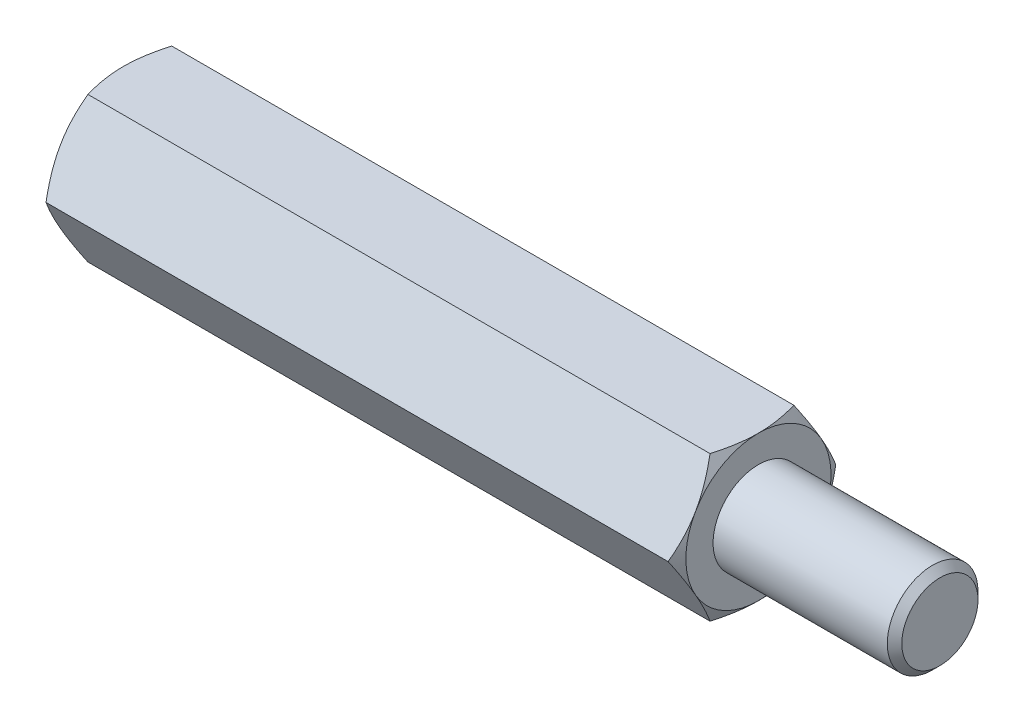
ISO-10303-21;
HEADER;
FILE_DESCRIPTION(('STEP AP214'),'2;1');
FILE_NAME('part.step','',(''),(''),'','','');
FILE_SCHEMA(('AUTOMOTIVE_DESIGN { 1 0 10303 214 1 1 1 1 }'));
ENDSEC;
DATA;
#1=APPLICATION_CONTEXT('core data for automotive mechanical design processes');
#2=APPLICATION_PROTOCOL_DEFINITION('international standard','automotive_design',2000,#1);
#3=PRODUCT_CONTEXT('',#1,'mechanical');
#4=PRODUCT('Part','Part','',(#3));
#5=PRODUCT_RELATED_PRODUCT_CATEGORY('part','',(#4));
#6=PRODUCT_DEFINITION_FORMATION('','',#4);
#7=PRODUCT_DEFINITION_CONTEXT('part definition',#1,'design');
#8=PRODUCT_DEFINITION('design','',#6,#7);
#9=PRODUCT_DEFINITION_SHAPE('','',#8);
#10=(LENGTH_UNIT() NAMED_UNIT(*) SI_UNIT(.MILLI.,.METRE.));
#11=(NAMED_UNIT(*) PLANE_ANGLE_UNIT() SI_UNIT($,.RADIAN.));
#12=(NAMED_UNIT(*) SI_UNIT($,.STERADIAN.) SOLID_ANGLE_UNIT());
#13=UNCERTAINTY_MEASURE_WITH_UNIT(LENGTH_MEASURE(1.E-05),#10,'distance_accuracy_value','');
#14=(GEOMETRIC_REPRESENTATION_CONTEXT(3) GLOBAL_UNCERTAINTY_ASSIGNED_CONTEXT((#13)) GLOBAL_UNIT_ASSIGNED_CONTEXT((#10,
#11,#12)) REPRESENTATION_CONTEXT('',''));
#15=CARTESIAN_POINT('',(0.,0.,0.));
#16=DIRECTION('',(0.,0.,1.));
#17=DIRECTION('',(1.,0.,0.));
#18=AXIS2_PLACEMENT_3D('',#15,#16,#17);
#19=CARTESIAN_POINT('',(17.5,4.,-2.3094010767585));
#20=DIRECTION('',(1.,0.,0.));
#21=DIRECTION('',(0.,0.,-1.));
#22=AXIS2_PLACEMENT_3D('',#19,#20,#21);
#23=PLANE('',#22);
#24=CARTESIAN_POINT('',(17.5,0.,0.));
#25=DIRECTION('',(1.,0.,0.));
#26=DIRECTION('',(0.,0.,-1.));
#27=AXIS2_PLACEMENT_3D('',#24,#25,#26);
#28=CIRCLE('',#27,4.);
#29=CARTESIAN_POINT('',(17.5,-2.,-3.46410161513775));
#30=VERTEX_POINT('',#29);
#31=CARTESIAN_POINT('',(17.5,2.,-3.46410161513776));
#32=VERTEX_POINT('',#31);
#33=EDGE_CURVE('E288',#30,#32,#28,.T.);
#34=ORIENTED_EDGE('',*,*,#33,.T.);
#35=CARTESIAN_POINT('',(17.5,4.,0.));
#36=VERTEX_POINT('',#35);
#37=EDGE_CURVE('E53',#32,#36,#28,.T.);
#38=ORIENTED_EDGE('',*,*,#37,.T.);
#39=CARTESIAN_POINT('',(17.5,2.,3.46410161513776));
#40=VERTEX_POINT('',#39);
#41=EDGE_CURVE('E297',#36,#40,#28,.T.);
#42=ORIENTED_EDGE('',*,*,#41,.T.);
#43=CARTESIAN_POINT('',(17.5,-2.,3.46410161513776));
#44=VERTEX_POINT('',#43);
#45=EDGE_CURVE('E303',#40,#44,#28,.T.);
#46=ORIENTED_EDGE('',*,*,#45,.T.);
#47=CARTESIAN_POINT('',(17.5,0.,0.));
#48=DIRECTION('',(-1.,0.,0.));
#49=DIRECTION('',(0.,-1.,0.));
#50=AXIS2_PLACEMENT_3D('',#47,#48,#49);
#51=CIRCLE('',#50,4.);
#52=CARTESIAN_POINT('',(17.5,-4.00000000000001,0.));
#53=VERTEX_POINT('',#52);
#54=EDGE_CURVE('E193',#53,#44,#51,.T.);
#55=ORIENTED_EDGE('',*,*,#54,.F.);
#56=EDGE_CURVE('E61',#53,#30,#28,.T.);
#57=ORIENTED_EDGE('',*,*,#56,.T.);
#58=EDGE_LOOP('',(#34,#38,#42,#46,#55,#57));
#59=FACE_BOUND('',#58,.T.);
#60=CARTESIAN_POINT('',(17.5,0.,0.));
#61=DIRECTION('',(1.,0.,0.));
#62=DIRECTION('',(0.,0.,-1.));
#63=AXIS2_PLACEMENT_3D('',#60,#61,#62);
#64=CIRCLE('',#63,2.5);
#65=CARTESIAN_POINT('',(17.5,0.,-2.5));
#66=VERTEX_POINT('',#65);
#67=EDGE_CURVE('E392',#66,#66,#64,.T.);
#68=ORIENTED_EDGE('',*,*,#67,.F.);
#69=EDGE_LOOP('',(#68));
#70=FACE_BOUND('',#69,.T.);
#71=ADVANCED_FACE('F37',(#59,#70),#23,.T.);
#72=CARTESIAN_POINT('',(17.5,0.,-4.61880215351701));
#73=DIRECTION('',(0.,-0.5,0.866025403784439));
#74=DIRECTION('',(0.,-0.866025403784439,-0.5));
#75=AXIS2_PLACEMENT_3D('',#72,#73,#74);
#76=PLANE('',#75);
#77=CARTESIAN_POINT('',(17.1426677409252,-0.000200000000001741,-4.61891762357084));
#78=CARTESIAN_POINT('',(17.2012821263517,0.175579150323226,-4.5174314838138));
#79=CARTESIAN_POINT('',(17.2545896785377,0.352875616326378,-4.41506932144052));
#80=CARTESIAN_POINT('',(17.3476383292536,0.710538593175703,-4.20857250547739));
#81=CARTESIAN_POINT('',(17.3873465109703,0.890911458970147,-4.10443418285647));
#82=CARTESIAN_POINT('',(17.4491577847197,1.24942181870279,-3.89744813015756));
#83=CARTESIAN_POINT('',(17.4716722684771,1.42750415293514,-3.79463224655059));
#84=CARTESIAN_POINT('',(17.4985493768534,1.7845067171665,-3.58851671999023));
#85=CARTESIAN_POINT('',(17.5029342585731,1.96342564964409,-3.48521782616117));
#86=CARTESIAN_POINT('',(17.49380992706,2.29774284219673,-3.29219970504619));
#87=CARTESIAN_POINT('',(17.482541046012,2.45319115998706,-3.20245157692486));
#88=CARTESIAN_POINT('',(17.4468260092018,2.76307505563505,-3.02354002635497));
#89=CARTESIAN_POINT('',(17.4223676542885,2.91750956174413,-2.93437722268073));
#90=CARTESIAN_POINT('',(17.3612239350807,3.22803232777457,-2.75509682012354));
#91=CARTESIAN_POINT('',(17.3242793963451,3.3840812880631,-2.6650019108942));
#92=CARTESIAN_POINT('',(17.240429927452,3.69385183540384,-2.48615580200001));
#93=CARTESIAN_POINT('',(17.1935446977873,3.84757739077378,-2.39740231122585));
#94=CARTESIAN_POINT('',(17.1426677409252,4.0002,-2.30928560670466));
#95=B_SPLINE_CURVE_WITH_KNOTS('',3,(#77,#78,#79,#80,#81,#82,#83,#84,#85,#86,#87,#88,#89,#90,#91,
#92,#93,#94),.UNSPECIFIED.,.F.,.F.,(4,2,2,2,2,2,2,2,4),(0.,0.634047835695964,1.26961969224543,
1.88946157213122,2.50854226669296,3.04757825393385,3.58711366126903,4.13861653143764,
4.68903648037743),.UNSPECIFIED.);
#96=CARTESIAN_POINT('',(17.1427344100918,0.,-4.61880215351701));
#97=VERTEX_POINT('',#96);
#98=EDGE_CURVE('E317',#97,#32,#95,.T.);
#99=ORIENTED_EDGE('',*,*,#98,.F.);
#100=DIRECTION('',(-1.,0.,0.));
#101=VECTOR('',#100,1.);
#102=CARTESIAN_POINT('',(17.5,0.,-4.61880215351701));
#103=LINE('',#102,#101);
#104=CARTESIAN_POINT('',(-17.1427344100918,0.,-4.61880215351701));
#105=VERTEX_POINT('',#104);
#106=EDGE_CURVE('E264',#97,#105,#103,.T.);
#107=ORIENTED_EDGE('',*,*,#106,.T.);
#108=CARTESIAN_POINT('',(-17.1426677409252,4.0002,-2.30928560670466));
#109=CARTESIAN_POINT('',(-17.2012821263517,3.82442084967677,-2.4107717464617));
#110=CARTESIAN_POINT('',(-17.2545896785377,3.64712438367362,-2.51313390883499));
#111=CARTESIAN_POINT('',(-17.3476383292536,3.28946140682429,-2.71963072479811));
#112=CARTESIAN_POINT('',(-17.3873465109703,3.10908854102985,-2.82376904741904));
#113=CARTESIAN_POINT('',(-17.4491577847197,2.75057818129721,-3.03075510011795));
#114=CARTESIAN_POINT('',(-17.4716722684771,2.57249584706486,-3.13357098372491));
#115=CARTESIAN_POINT('',(-17.4985493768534,2.21549328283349,-3.33968651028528));
#116=CARTESIAN_POINT('',(-17.5029342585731,2.0365743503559,-3.44298540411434));
#117=CARTESIAN_POINT('',(-17.49380992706,1.70225715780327,-3.63600352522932));
#118=CARTESIAN_POINT('',(-17.482541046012,1.54680884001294,-3.72575165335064));
#119=CARTESIAN_POINT('',(-17.4468260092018,1.23692494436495,-3.90466320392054));
#120=CARTESIAN_POINT('',(-17.4223676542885,1.08249043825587,-3.99382600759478));
#121=CARTESIAN_POINT('',(-17.3612239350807,0.771967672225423,-4.17310641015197));
#122=CARTESIAN_POINT('',(-17.3242793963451,0.615918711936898,-4.26320131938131));
#123=CARTESIAN_POINT('',(-17.240429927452,0.30614816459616,-4.4420474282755));
#124=CARTESIAN_POINT('',(-17.1935446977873,0.15242260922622,-4.53080091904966));
#125=CARTESIAN_POINT('',(-17.1426677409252,-0.000200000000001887,-4.61891762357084));
#126=B_SPLINE_CURVE_WITH_KNOTS('',3,(#108,#109,#110,#111,#112,#113,#114,#115,#116,#117,#118,
#119,#120,#121,#122,#123,#124,#125),.UNSPECIFIED.,.F.,.F.,(4,2,2,2,2,2,2,2,4),(0.,
0.634047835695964,1.26961969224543,1.88946157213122,2.50854226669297,3.04757825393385,
3.58711366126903,4.13861653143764,4.68903648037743),.UNSPECIFIED.);
#127=CARTESIAN_POINT('',(-17.5,2.,-3.46410161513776));
#128=VERTEX_POINT('',#127);
#129=EDGE_CURVE('E332',#128,#105,#126,.T.);
#130=ORIENTED_EDGE('',*,*,#129,.F.);
#131=CARTESIAN_POINT('',(-17.1427344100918,4.,-2.3094010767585));
#132=VERTEX_POINT('',#131);
#133=EDGE_CURVE('E335',#132,#128,#126,.T.);
#134=ORIENTED_EDGE('',*,*,#133,.F.);
#135=DIRECTION('',(-1.,0.,0.));
#136=VECTOR('',#135,1.);
#137=CARTESIAN_POINT('',(17.5,4.,-2.3094010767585));
#138=LINE('',#137,#136);
#139=CARTESIAN_POINT('',(17.142734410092,4.,-2.30940107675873));
#140=VERTEX_POINT('',#139);
#141=EDGE_CURVE('E279',#140,#132,#138,.T.);
#142=ORIENTED_EDGE('',*,*,#141,.F.);
#143=EDGE_CURVE('E229',#32,#140,#95,.T.);
#144=ORIENTED_EDGE('',*,*,#143,.F.);
#145=EDGE_LOOP('',(#99,#107,#130,#134,#142,#144));
#146=FACE_BOUND('',#145,.T.);
#147=ADVANCED_FACE('F148',(#146),#76,.F.);
#148=CARTESIAN_POINT('',(17.5,4.,-2.3094010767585));
#149=DIRECTION('',(0.,-1.,0.));
#150=DIRECTION('',(0.,0.,-1.));
#151=AXIS2_PLACEMENT_3D('',#148,#149,#150);
#152=PLANE('',#151);
#153=CARTESIAN_POINT('',(15.5082907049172,4.,-6.28479524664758));
#154=CARTESIAN_POINT('',(15.5937006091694,4.,-6.10939349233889));
#155=CARTESIAN_POINT('',(15.6783148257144,4.,-5.93359774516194));
#156=CARTESIAN_POINT('',(15.8455059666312,4.,-5.58100905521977));
#157=CARTESIAN_POINT('',(15.9280825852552,4.,-5.40421596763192));
#158=CARTESIAN_POINT('',(16.0911508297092,4.,-5.04855089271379));
#159=CARTESIAN_POINT('',(16.1716293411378,4.,-4.86967287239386));
#160=CARTESIAN_POINT('',(16.329400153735,4.,-4.51052237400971));
#161=CARTESIAN_POINT('',(16.406692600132,4.,-4.33024995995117));
#162=CARTESIAN_POINT('',(16.559802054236,4.,-3.96189114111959));
#163=CARTESIAN_POINT('',(16.635480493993,4.,-3.77374683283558));
#164=CARTESIAN_POINT('',(16.7813045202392,4.,-3.39528725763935));
#165=CARTESIAN_POINT('',(16.8514494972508,4.,-3.2049717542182));
#166=CARTESIAN_POINT('',(16.9844245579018,4.,-2.82219775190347));
#167=CARTESIAN_POINT('',(17.0472687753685,4.,-2.62974421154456));
#168=CARTESIAN_POINT('',(17.1636796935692,4.,-2.24207725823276));
#169=CARTESIAN_POINT('',(17.2172492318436,4.,-2.04686470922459));
#170=CARTESIAN_POINT('',(17.3123031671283,4.,-1.65467425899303));
#171=CARTESIAN_POINT('',(17.3538563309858,4.,-1.45771333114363));
#172=CARTESIAN_POINT('',(17.4225903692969,4.,-1.06125849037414));
#173=CARTESIAN_POINT('',(17.4497727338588,4.,-0.861764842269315));
#174=CARTESIAN_POINT('',(17.4872447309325,4.,-0.463879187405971));
#175=CARTESIAN_POINT('',(17.4977578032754,4.,-0.265508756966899));
#176=CARTESIAN_POINT('',(17.5015934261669,4.,0.131417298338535));
#177=CARTESIAN_POINT('',(17.4949158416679,4.,0.32997292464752));
#178=CARTESIAN_POINT('',(17.4696489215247,4.,0.66469218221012));
#179=CARTESIAN_POINT('',(17.4553708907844,4.,0.801202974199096));
#180=CARTESIAN_POINT('',(17.4195349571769,4.,1.07327201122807));
#181=CARTESIAN_POINT('',(17.3979761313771,4.,1.20883013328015));
#182=CARTESIAN_POINT('',(17.3235066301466,4.,1.61386939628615));
#183=CARTESIAN_POINT('',(17.2608149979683,4.,1.88157484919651));
#184=CARTESIAN_POINT('',(17.1515117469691,4.,2.28197262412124));
#185=CARTESIAN_POINT('',(17.112009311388,4.,2.41672443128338));
#186=CARTESIAN_POINT('',(17.0287523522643,4.,2.68492067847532));
#187=CARTESIAN_POINT('',(16.9849977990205,4.,2.81836510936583));
#188=CARTESIAN_POINT('',(16.8939510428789,4.,3.08398596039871));
#189=CARTESIAN_POINT('',(16.846659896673,4.,3.21616274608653));
#190=CARTESIAN_POINT('',(16.7491111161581,4.,3.47941134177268));
#191=CARTESIAN_POINT('',(16.6988535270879,4.,3.61048316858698));
#192=CARTESIAN_POINT('',(16.5713295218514,4.,3.93385125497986));
#193=CARTESIAN_POINT('',(16.4926014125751,4.,4.12557021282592));
#194=CARTESIAN_POINT('',(16.3309693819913,4.,4.50724553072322));
#195=CARTESIAN_POINT('',(16.2480651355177,4.,4.69720175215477));
#196=CARTESIAN_POINT('',(16.0789699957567,4.,5.07569950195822));
#197=CARTESIAN_POINT('',(15.9927782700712,4.,5.26424065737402));
#198=CARTESIAN_POINT('',(15.8178011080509,4.,5.64011758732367));
#199=CARTESIAN_POINT('',(15.7290156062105,4.,5.82745333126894));
#200=CARTESIAN_POINT('',(15.4593432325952,4.,6.38844423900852));
#201=CARTESIAN_POINT('',(15.2753561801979,4.,6.76060781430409));
#202=CARTESIAN_POINT('',(14.9019562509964,4.,7.50211228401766));
#203=CARTESIAN_POINT('',(14.7125442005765,4.,7.87145359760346));
#204=CARTESIAN_POINT('',(14.3473877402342,4.,8.57450173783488));
#205=CARTESIAN_POINT('',(14.171975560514,4.,8.90838144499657));
#206=CARTESIAN_POINT('',(13.8188097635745,4.,9.57491712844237));
#207=CARTESIAN_POINT('',(13.6410560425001,4.,9.90757304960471));
#208=CARTESIAN_POINT('',(13.2842933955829,4.,10.5709822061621));
#209=CARTESIAN_POINT('',(13.1052895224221,3.99999999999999,10.9017381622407));
#210=CARTESIAN_POINT('',(12.7459071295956,3.99999999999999,11.5624752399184));
#211=CARTESIAN_POINT('',(12.5655286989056,3.99999999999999,11.8924564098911));
#212=CARTESIAN_POINT('',(12.384642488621,3.99999999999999,12.2221569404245));
#213=B_SPLINE_CURVE_WITH_KNOTS('',3,(#153,#154,#155,#156,#157,#158,#159,#160,#161,#162,#163,
#164,#165,#166,#167,#168,#169,#170,#171,#172,#173,#174,#175,#176,#177,#178,#179,#180,#181,#182,
#183,#184,#185,#186,#187,#188,#189,#190,#191,#192,#193,#194,#195,#196,#197,#198,#199,#200,#201,
#202,#203,#204,#205,#206,#207,#208,#209,#210,#211,#212),.UNSPECIFIED.,.F.,.F.,(4,2,2,2,2,2,2,2,
2,2,2,2,2,2,2,2,2,2,2,2,2,2,2,2,2,2,2,2,2,4),(0.,0.58528075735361,1.17064881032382,
1.75906864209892,2.34746162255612,2.95577704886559,3.56415938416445,4.17134357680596,
4.7783416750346,5.38179402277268,5.98518378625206,6.58041501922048,7.17565092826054,
7.5872191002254,7.99883946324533,8.82250155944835,9.24373134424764,9.66496407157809,
10.086071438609,10.5071723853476,11.1288656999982,11.7506074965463,12.3725077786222,
12.9944237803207,14.2398211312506,15.4850297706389,16.6164791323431,17.7479788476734,
18.8762380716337,20.0044248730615),.UNSPECIFIED.);
#214=EDGE_CURVE('E227',#140,#36,#213,.T.);
#215=ORIENTED_EDGE('',*,*,#214,.F.);
#216=ORIENTED_EDGE('',*,*,#141,.T.);
#217=CARTESIAN_POINT('',(-15.5082907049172,4.,-6.28479524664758));
#218=CARTESIAN_POINT('',(-15.5937006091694,4.,-6.10939349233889));
#219=CARTESIAN_POINT('',(-15.6783148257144,4.,-5.93359774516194));
#220=CARTESIAN_POINT('',(-15.8455059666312,4.,-5.58100905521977));
#221=CARTESIAN_POINT('',(-15.9280825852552,4.,-5.40421596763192));
#222=CARTESIAN_POINT('',(-16.0911508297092,4.,-5.04855089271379));
#223=CARTESIAN_POINT('',(-16.1716293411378,4.,-4.86967287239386));
#224=CARTESIAN_POINT('',(-16.329400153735,4.,-4.51052237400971));
#225=CARTESIAN_POINT('',(-16.406692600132,4.,-4.33024995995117));
#226=CARTESIAN_POINT('',(-16.559802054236,4.,-3.96189114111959));
#227=CARTESIAN_POINT('',(-16.635480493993,4.,-3.77374683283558));
#228=CARTESIAN_POINT('',(-16.7813045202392,4.,-3.39528725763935));
#229=CARTESIAN_POINT('',(-16.8514494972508,4.,-3.2049717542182));
#230=CARTESIAN_POINT('',(-16.9844245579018,4.,-2.82219775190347));
#231=CARTESIAN_POINT('',(-17.0472687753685,4.,-2.62974421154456));
#232=CARTESIAN_POINT('',(-17.1636796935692,4.,-2.24207725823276));
#233=CARTESIAN_POINT('',(-17.2172492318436,4.,-2.04686470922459));
#234=CARTESIAN_POINT('',(-17.3123031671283,4.,-1.65467425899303));
#235=CARTESIAN_POINT('',(-17.3538563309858,4.,-1.45771333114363));
#236=CARTESIAN_POINT('',(-17.4225903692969,4.,-1.06125849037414));
#237=CARTESIAN_POINT('',(-17.4497727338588,4.,-0.861764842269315));
#238=CARTESIAN_POINT('',(-17.4872447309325,4.,-0.463879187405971));
#239=CARTESIAN_POINT('',(-17.4977578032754,4.,-0.265508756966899));
#240=CARTESIAN_POINT('',(-17.5015934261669,4.,0.131417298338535));
#241=CARTESIAN_POINT('',(-17.4949158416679,4.,0.32997292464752));
#242=CARTESIAN_POINT('',(-17.4696489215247,4.,0.66469218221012));
#243=CARTESIAN_POINT('',(-17.4553708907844,4.,0.801202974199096));
#244=CARTESIAN_POINT('',(-17.4195349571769,4.,1.07327201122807));
#245=CARTESIAN_POINT('',(-17.3979761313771,4.,1.20883013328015));
#246=CARTESIAN_POINT('',(-17.3235066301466,4.,1.61386939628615));
#247=CARTESIAN_POINT('',(-17.2608149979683,4.,1.88157484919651));
#248=CARTESIAN_POINT('',(-17.1515117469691,4.,2.28197262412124));
#249=CARTESIAN_POINT('',(-17.112009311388,4.,2.41672443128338));
#250=CARTESIAN_POINT('',(-17.0287523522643,4.,2.68492067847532));
#251=CARTESIAN_POINT('',(-16.9849977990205,4.,2.81836510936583));
#252=CARTESIAN_POINT('',(-16.8939510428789,4.,3.08398596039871));
#253=CARTESIAN_POINT('',(-16.846659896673,4.,3.21616274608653));
#254=CARTESIAN_POINT('',(-16.7491111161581,4.,3.47941134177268));
#255=CARTESIAN_POINT('',(-16.6988535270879,4.,3.61048316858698));
#256=CARTESIAN_POINT('',(-16.5713295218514,4.,3.93385125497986));
#257=CARTESIAN_POINT('',(-16.4926014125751,4.,4.12557021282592));
#258=CARTESIAN_POINT('',(-16.3309693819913,4.,4.50724553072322));
#259=CARTESIAN_POINT('',(-16.2480651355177,4.,4.69720175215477));
#260=CARTESIAN_POINT('',(-16.0789699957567,4.,5.07569950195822));
#261=CARTESIAN_POINT('',(-15.9927782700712,4.,5.26424065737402));
#262=CARTESIAN_POINT('',(-15.8178011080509,4.,5.64011758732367));
#263=CARTESIAN_POINT('',(-15.7290156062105,4.,5.82745333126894));
#264=CARTESIAN_POINT('',(-15.4593432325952,4.,6.38844423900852));
#265=CARTESIAN_POINT('',(-15.2753561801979,4.,6.76060781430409));
#266=CARTESIAN_POINT('',(-14.9019562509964,4.,7.50211228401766));
#267=CARTESIAN_POINT('',(-14.7125442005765,4.,7.87145359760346));
#268=CARTESIAN_POINT('',(-14.3473877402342,4.,8.57450173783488));
#269=CARTESIAN_POINT('',(-14.171975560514,4.,8.90838144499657));
#270=CARTESIAN_POINT('',(-13.8188097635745,4.,9.57491712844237));
#271=CARTESIAN_POINT('',(-13.6410560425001,4.,9.90757304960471));
#272=CARTESIAN_POINT('',(-13.2842933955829,4.,10.5709822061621));
#273=CARTESIAN_POINT('',(-13.1052895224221,3.99999999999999,10.9017381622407));
#274=CARTESIAN_POINT('',(-12.7459071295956,3.99999999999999,11.5624752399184));
#275=CARTESIAN_POINT('',(-12.5655286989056,3.99999999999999,11.8924564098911));
#276=CARTESIAN_POINT('',(-12.384642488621,3.99999999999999,12.2221569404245));
#277=B_SPLINE_CURVE_WITH_KNOTS('',3,(#217,#218,#219,#220,#221,#222,#223,#224,#225,#226,#227,
#228,#229,#230,#231,#232,#233,#234,#235,#236,#237,#238,#239,#240,#241,#242,#243,#244,#245,#246,
#247,#248,#249,#250,#251,#252,#253,#254,#255,#256,#257,#258,#259,#260,#261,#262,#263,#264,#265,
#266,#267,#268,#269,#270,#271,#272,#273,#274,#275,#276),.UNSPECIFIED.,.F.,.F.,(4,2,2,2,2,2,2,2,
2,2,2,2,2,2,2,2,2,2,2,2,2,2,2,2,2,2,2,2,2,4),(0.,0.58528075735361,1.17064881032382,
1.75906864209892,2.34746162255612,2.95577704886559,3.56415938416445,4.17134357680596,
4.7783416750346,5.38179402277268,5.98518378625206,6.58041501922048,7.17565092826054,
7.5872191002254,7.99883946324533,8.82250155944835,9.24373134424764,9.66496407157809,
10.086071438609,10.5071723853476,11.1288656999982,11.7506074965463,12.3725077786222,
12.9944237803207,14.2398211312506,15.4850297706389,16.6164791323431,17.7479788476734,
18.8762380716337,20.0044248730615),.UNSPECIFIED.);
#278=CARTESIAN_POINT('',(-17.5,4.,0.));
#279=VERTEX_POINT('',#278);
#280=EDGE_CURVE('E241',#279,#132,#277,.F.);
#281=ORIENTED_EDGE('',*,*,#280,.F.);
#282=CARTESIAN_POINT('',(-17.1427344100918,4.,2.3094010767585));
#283=VERTEX_POINT('',#282);
#284=EDGE_CURVE('E249',#283,#279,#277,.F.);
#285=ORIENTED_EDGE('',*,*,#284,.F.);
#286=DIRECTION('',(-1.,0.,0.));
#287=VECTOR('',#286,1.);
#288=CARTESIAN_POINT('',(17.5,4.,2.3094010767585));
#289=LINE('',#288,#287);
#290=CARTESIAN_POINT('',(17.1427344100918,4.,2.3094010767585));
#291=VERTEX_POINT('',#290);
#292=EDGE_CURVE('E276',#291,#283,#289,.T.);
#293=ORIENTED_EDGE('',*,*,#292,.F.);
#294=EDGE_CURVE('E221',#36,#291,#213,.T.);
#295=ORIENTED_EDGE('',*,*,#294,.F.);
#296=EDGE_LOOP('',(#215,#216,#281,#285,#293,#295));
#297=FACE_BOUND('',#296,.T.);
#298=ADVANCED_FACE('F153',(#297),#152,.F.);
#299=CARTESIAN_POINT('',(17.5,4.,2.3094010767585));
#300=DIRECTION('',(0.,-0.5,-0.866025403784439));
#301=DIRECTION('',(0.,0.866025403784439,-0.5));
#302=AXIS2_PLACEMENT_3D('',#299,#300,#301);
#303=PLANE('',#302);
#304=CARTESIAN_POINT('',(17.1426677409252,4.0002,2.30928560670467));
#305=CARTESIAN_POINT('',(17.2012821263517,3.82442084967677,2.4107717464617));
#306=CARTESIAN_POINT('',(17.2545896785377,3.64712438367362,2.51313390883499));
#307=CARTESIAN_POINT('',(17.3476383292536,3.28946140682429,2.71963072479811));
#308=CARTESIAN_POINT('',(17.3873465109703,3.10908854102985,2.82376904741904));
#309=CARTESIAN_POINT('',(17.4491577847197,2.75057818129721,3.03075510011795));
#310=CARTESIAN_POINT('',(17.4716722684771,2.57249584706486,3.13357098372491));
#311=CARTESIAN_POINT('',(17.4985493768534,2.21549328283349,3.33968651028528));
#312=CARTESIAN_POINT('',(17.5029342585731,2.0365743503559,3.44298540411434));
#313=CARTESIAN_POINT('',(17.49380992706,1.70225715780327,3.63600352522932));
#314=CARTESIAN_POINT('',(17.482541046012,1.54680884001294,3.72575165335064));
#315=CARTESIAN_POINT('',(17.4468260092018,1.23692494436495,3.90466320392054));
#316=CARTESIAN_POINT('',(17.4223676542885,1.08249043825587,3.99382600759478));
#317=CARTESIAN_POINT('',(17.3612239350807,0.771967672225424,4.17310641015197));
#318=CARTESIAN_POINT('',(17.3242793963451,0.615918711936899,4.26320131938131));
#319=CARTESIAN_POINT('',(17.240429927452,0.306148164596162,4.4420474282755));
#320=CARTESIAN_POINT('',(17.1935446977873,0.152422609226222,4.53080091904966));
#321=CARTESIAN_POINT('',(17.1426677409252,-0.00019999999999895,4.61891762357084));
#322=B_SPLINE_CURVE_WITH_KNOTS('',3,(#304,#305,#306,#307,#308,#309,#310,#311,#312,#313,#314,
#315,#316,#317,#318,#319,#320,#321),.UNSPECIFIED.,.F.,.F.,(4,2,2,2,2,2,2,2,4),(0.,
0.634047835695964,1.26961969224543,1.88946157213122,2.50854226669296,3.04757825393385,
3.58711366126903,4.13861653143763,4.68903648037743),.UNSPECIFIED.);
#323=EDGE_CURVE('E228',#291,#40,#322,.T.);
#324=ORIENTED_EDGE('',*,*,#323,.F.);
#325=ORIENTED_EDGE('',*,*,#292,.T.);
#326=CARTESIAN_POINT('',(-17.1426677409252,-0.000199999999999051,4.61891762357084));
#327=CARTESIAN_POINT('',(-17.2012821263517,0.175579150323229,4.5174314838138));
#328=CARTESIAN_POINT('',(-17.2545896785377,0.352875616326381,4.41506932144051));
#329=CARTESIAN_POINT('',(-17.3476383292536,0.710538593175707,4.20857250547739));
#330=CARTESIAN_POINT('',(-17.3873465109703,0.89091145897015,4.10443418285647));
#331=CARTESIAN_POINT('',(-17.4491577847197,1.24942181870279,3.89744813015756));
#332=CARTESIAN_POINT('',(-17.4716722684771,1.42750415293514,3.79463224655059));
#333=CARTESIAN_POINT('',(-17.4985493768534,1.78450671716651,3.58851671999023));
#334=CARTESIAN_POINT('',(-17.5029342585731,1.9634256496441,3.48521782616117));
#335=CARTESIAN_POINT('',(-17.49380992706,2.29774284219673,3.29219970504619));
#336=CARTESIAN_POINT('',(-17.482541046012,2.45319115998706,3.20245157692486));
#337=CARTESIAN_POINT('',(-17.4468260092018,2.76307505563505,3.02354002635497));
#338=CARTESIAN_POINT('',(-17.4223676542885,2.91750956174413,2.93437722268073));
#339=CARTESIAN_POINT('',(-17.3612239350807,3.22803232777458,2.75509682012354));
#340=CARTESIAN_POINT('',(-17.3242793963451,3.3840812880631,2.6650019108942));
#341=CARTESIAN_POINT('',(-17.240429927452,3.69385183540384,2.48615580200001));
#342=CARTESIAN_POINT('',(-17.1935446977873,3.84757739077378,2.39740231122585));
#343=CARTESIAN_POINT('',(-17.1426677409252,4.0002,2.30928560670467));
#344=B_SPLINE_CURVE_WITH_KNOTS('',3,(#326,#327,#328,#329,#330,#331,#332,#333,#334,#335,#336,
#337,#338,#339,#340,#341,#342,#343),.UNSPECIFIED.,.F.,.F.,(4,2,2,2,2,2,2,2,4),(0.,
0.634047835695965,1.26961969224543,1.88946157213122,2.50854226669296,3.04757825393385,
3.58711366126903,4.13861653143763,4.68903648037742),.UNSPECIFIED.);
#345=CARTESIAN_POINT('',(-17.5,2.,3.46410161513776));
#346=VERTEX_POINT('',#345);
#347=EDGE_CURVE('E255',#346,#283,#344,.T.);
#348=ORIENTED_EDGE('',*,*,#347,.F.);
#349=CARTESIAN_POINT('',(-17.1427344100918,0.,4.618802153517));
#350=VERTEX_POINT('',#349);
#351=EDGE_CURVE('E262',#350,#346,#344,.T.);
#352=ORIENTED_EDGE('',*,*,#351,.F.);
#353=DIRECTION('',(-1.,0.,0.));
#354=VECTOR('',#353,1.);
#355=CARTESIAN_POINT('',(17.5,0.,4.618802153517));
#356=LINE('',#355,#354);
#357=CARTESIAN_POINT('',(17.1427344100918,0.,4.618802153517));
#358=VERTEX_POINT('',#357);
#359=EDGE_CURVE('E273',#358,#350,#356,.T.);
#360=ORIENTED_EDGE('',*,*,#359,.F.);
#361=EDGE_CURVE('E215',#40,#358,#322,.T.);
#362=ORIENTED_EDGE('',*,*,#361,.F.);
#363=EDGE_LOOP('',(#324,#325,#348,#352,#360,#362));
#364=FACE_BOUND('',#363,.T.);
#365=ADVANCED_FACE('F235',(#364),#303,.F.);
#366=CARTESIAN_POINT('',(17.5,0.,4.618802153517));
#367=DIRECTION('',(0.,0.5,-0.866025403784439));
#368=DIRECTION('',(0.,0.866025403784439,0.5));
#369=AXIS2_PLACEMENT_3D('',#366,#367,#368);
#370=PLANE('',#369);
#371=CARTESIAN_POINT('',(17.1426677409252,0.000200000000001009,4.61891762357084));
#372=CARTESIAN_POINT('',(17.2012821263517,-0.175579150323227,4.5174314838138));
#373=CARTESIAN_POINT('',(17.2545896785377,-0.35287561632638,4.41506932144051));
#374=CARTESIAN_POINT('',(17.3476383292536,-0.710538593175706,4.20857250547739));
#375=CARTESIAN_POINT('',(17.3873465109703,-0.89091145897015,4.10443418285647));
#376=CARTESIAN_POINT('',(17.4491577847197,-1.24942181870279,3.89744813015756));
#377=CARTESIAN_POINT('',(17.4716722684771,-1.42750415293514,3.79463224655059));
#378=CARTESIAN_POINT('',(17.4985493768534,-1.78450671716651,3.58851671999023));
#379=CARTESIAN_POINT('',(17.5029342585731,-1.9634256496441,3.48521782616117));
#380=CARTESIAN_POINT('',(17.49380992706,-2.29774284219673,3.29219970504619));
#381=CARTESIAN_POINT('',(17.482541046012,-2.45319115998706,3.20245157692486));
#382=CARTESIAN_POINT('',(17.4468260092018,-2.76307505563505,3.02354002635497));
#383=CARTESIAN_POINT('',(17.4223676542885,-2.91750956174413,2.93437722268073));
#384=CARTESIAN_POINT('',(17.3612239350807,-3.22803232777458,2.75509682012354));
#385=CARTESIAN_POINT('',(17.3242793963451,-3.3840812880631,2.6650019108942));
#386=CARTESIAN_POINT('',(17.240429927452,-3.69385183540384,2.48615580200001));
#387=CARTESIAN_POINT('',(17.1935446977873,-3.84757739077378,2.39740231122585));
#388=CARTESIAN_POINT('',(17.1426677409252,-4.0002,2.30928560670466));
#389=B_SPLINE_CURVE_WITH_KNOTS('',3,(#371,#372,#373,#374,#375,#376,#377,#378,#379,#380,#381,
#382,#383,#384,#385,#386,#387,#388),.UNSPECIFIED.,.F.,.F.,(4,2,2,2,2,2,2,2,4),(0.,
0.634047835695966,1.26961969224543,1.88946157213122,2.50854226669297,3.04757825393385,
3.58711366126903,4.13861653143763,4.68903648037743),.UNSPECIFIED.);
#390=EDGE_CURVE('E324',#358,#44,#389,.T.);
#391=ORIENTED_EDGE('',*,*,#390,.F.);
#392=ORIENTED_EDGE('',*,*,#359,.T.);
#393=CARTESIAN_POINT('',(-17.1426677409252,-4.0002,2.30928560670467));
#394=CARTESIAN_POINT('',(-17.2012821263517,-3.82442084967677,2.4107717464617));
#395=CARTESIAN_POINT('',(-17.2545896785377,-3.64712438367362,2.51313390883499));
#396=CARTESIAN_POINT('',(-17.3476383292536,-3.28946140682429,2.71963072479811));
#397=CARTESIAN_POINT('',(-17.3873465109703,-3.10908854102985,2.82376904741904));
#398=CARTESIAN_POINT('',(-17.4491577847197,-2.75057818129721,3.03075510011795));
#399=CARTESIAN_POINT('',(-17.4716722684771,-2.57249584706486,3.13357098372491));
#400=CARTESIAN_POINT('',(-17.4985493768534,-2.21549328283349,3.33968651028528));
#401=CARTESIAN_POINT('',(-17.5029342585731,-2.0365743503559,3.44298540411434));
#402=CARTESIAN_POINT('',(-17.49380992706,-1.70225715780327,3.63600352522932));
#403=CARTESIAN_POINT('',(-17.482541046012,-1.54680884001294,3.72575165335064));
#404=CARTESIAN_POINT('',(-17.4468260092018,-1.23692494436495,3.90466320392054));
#405=CARTESIAN_POINT('',(-17.4223676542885,-1.08249043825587,3.99382600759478));
#406=CARTESIAN_POINT('',(-17.3612239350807,-0.771967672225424,4.17310641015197));
#407=CARTESIAN_POINT('',(-17.3242793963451,-0.615918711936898,4.26320131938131));
#408=CARTESIAN_POINT('',(-17.240429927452,-0.30614816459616,4.4420474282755));
#409=CARTESIAN_POINT('',(-17.1935446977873,-0.152422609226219,4.53080091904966));
#410=CARTESIAN_POINT('',(-17.1426677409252,0.000200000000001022,4.61891762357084));
#411=B_SPLINE_CURVE_WITH_KNOTS('',3,(#393,#394,#395,#396,#397,#398,#399,#400,#401,#402,#403,
#404,#405,#406,#407,#408,#409,#410),.UNSPECIFIED.,.F.,.F.,(4,2,2,2,2,2,2,2,4),(0.,
0.634047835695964,1.26961969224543,1.88946157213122,2.50854226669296,3.04757825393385,
3.58711366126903,4.13861653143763,4.68903648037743),.UNSPECIFIED.);
#412=CARTESIAN_POINT('',(-17.5,-2.,3.46410161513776));
#413=VERTEX_POINT('',#412);
#414=EDGE_CURVE('E263',#413,#350,#411,.T.);
#415=ORIENTED_EDGE('',*,*,#414,.F.);
#416=CARTESIAN_POINT('',(-17.1427344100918,-4.,2.3094010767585));
#417=VERTEX_POINT('',#416);
#418=EDGE_CURVE('E250',#417,#413,#411,.T.);
#419=ORIENTED_EDGE('',*,*,#418,.F.);
#420=DIRECTION('',(-1.,0.,0.));
#421=VECTOR('',#420,1.);
#422=CARTESIAN_POINT('',(17.5,-4.,2.3094010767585));
#423=LINE('',#422,#421);
#424=CARTESIAN_POINT('',(17.1427344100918,-4.,2.3094010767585));
#425=VERTEX_POINT('',#424);
#426=EDGE_CURVE('E270',#425,#417,#423,.T.);
#427=ORIENTED_EDGE('',*,*,#426,.F.);
#428=EDGE_CURVE('E210',#44,#425,#389,.T.);
#429=ORIENTED_EDGE('',*,*,#428,.F.);
#430=EDGE_LOOP('',(#391,#392,#415,#419,#427,#429));
#431=FACE_BOUND('',#430,.T.);
#432=ADVANCED_FACE('F374',(#431),#370,.F.);
#433=CARTESIAN_POINT('',(17.5,-4.,2.3094010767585));
#434=DIRECTION('',(0.,1.,0.));
#435=DIRECTION('',(0.,0.,1.));
#436=AXIS2_PLACEMENT_3D('',#433,#434,#435);
#437=PLANE('',#436);
#438=CARTESIAN_POINT('',(15.5082907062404,-4.,-6.28479524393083));
#439=CARTESIAN_POINT('',(15.5937006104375,-4.,-6.10939348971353));
#440=CARTESIAN_POINT('',(15.6783148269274,-4.,-5.93359774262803));
#441=CARTESIAN_POINT('',(15.8455059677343,-4.,-5.58100905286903));
#442=CARTESIAN_POINT('',(15.9280825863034,-4.,-5.40421596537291));
#443=CARTESIAN_POINT('',(16.0911508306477,-4.,-5.04855089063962));
#444=CARTESIAN_POINT('',(16.1716293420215,-4.,-4.8696728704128));
#445=CARTESIAN_POINT('',(16.3294001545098,-4.,-4.51052237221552));
#446=CARTESIAN_POINT('',(16.4066926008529,-4.,-4.33024995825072));
#447=CARTESIAN_POINT('',(16.5598020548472,-4.,-3.96189113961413));
#448=CARTESIAN_POINT('',(16.6354804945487,-4.,-3.77374683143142));
#449=CARTESIAN_POINT('',(16.7813045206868,-4.,-3.39528725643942));
#450=CARTESIAN_POINT('',(16.8514494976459,-4.,-3.20497175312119));
#451=CARTESIAN_POINT('',(16.9844245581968,-4.,-2.82219775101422));
#452=CARTESIAN_POINT('',(17.0472687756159,-4.,-2.62974421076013));
#453=CARTESIAN_POINT('',(17.1636796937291,-4.,-2.24207725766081));
#454=CARTESIAN_POINT('',(17.2172492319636,-4.,-2.04686470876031));
#455=CARTESIAN_POINT('',(17.3123031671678,-4.,-1.65467425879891));
#456=CARTESIAN_POINT('',(17.3538563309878,-4.,-1.45771333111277));
#457=CARTESIAN_POINT('',(17.4225903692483,-4.,-1.06125849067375));
#458=CARTESIAN_POINT('',(17.4497727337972,-4.,-0.861764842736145));
#459=CARTESIAN_POINT('',(17.4872447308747,-4.,-0.463879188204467));
#460=CARTESIAN_POINT('',(17.4977578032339,-4.,-0.265508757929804));
#461=CARTESIAN_POINT('',(17.5015934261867,-4.,0.13141729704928));
#462=CARTESIAN_POINT('',(17.4949158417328,-4.,0.329972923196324));
#463=CARTESIAN_POINT('',(17.4696489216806,-4.,0.664692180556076));
#464=CARTESIAN_POINT('',(17.4553708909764,-4.,0.80120297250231));
#465=CARTESIAN_POINT('',(17.4195349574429,-4.,1.07327200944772));
#466=CARTESIAN_POINT('',(17.3979761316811,-4.,1.208830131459));
#467=CARTESIAN_POINT('',(17.3235066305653,-4.,1.61386939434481));
#468=CARTESIAN_POINT('',(17.2608149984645,-4.,1.88157484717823));
#469=CARTESIAN_POINT('',(17.1515117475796,-4.,2.28197262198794));
#470=CARTESIAN_POINT('',(17.1120093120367,-4.,2.41672442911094));
#471=CARTESIAN_POINT('',(17.0287523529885,-4.,2.68492067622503));
#472=CARTESIAN_POINT('',(16.9849977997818,-4.,2.81836510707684));
#473=CARTESIAN_POINT('',(16.8939510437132,-4.,3.08398595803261));
#474=CARTESIAN_POINT('',(16.8466598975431,-4.,3.21616274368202));
#475=CARTESIAN_POINT('',(16.7491111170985,-4.,3.47941133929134));
#476=CARTESIAN_POINT('',(16.6988535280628,-4.,3.61048316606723));
#477=CARTESIAN_POINT('',(16.5713295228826,-4.,3.93385125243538));
#478=CARTESIAN_POINT('',(16.4926014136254,-4.,4.12557021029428));
#479=CARTESIAN_POINT('',(16.330969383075,-4.,4.50724552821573));
#480=CARTESIAN_POINT('',(16.2480651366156,-4.,4.69720174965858));
#481=CARTESIAN_POINT('',(16.0789699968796,-4.,5.07569949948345));
#482=CARTESIAN_POINT('',(15.9927782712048,-4.,5.26424065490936));
#483=CARTESIAN_POINT('',(15.8178011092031,-4.,5.64011758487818));
#484=CARTESIAN_POINT('',(15.7290156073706,-4.,5.82745332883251));
#485=CARTESIAN_POINT('',(15.4593432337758,-4.,6.38844423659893));
#486=CARTESIAN_POINT('',(15.275356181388,-4.,6.76060781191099));
#487=CARTESIAN_POINT('',(14.9019562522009,-4.,7.50211228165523));
#488=CARTESIAN_POINT('',(14.7125442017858,-4.,7.8714535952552));
#489=CARTESIAN_POINT('',(14.3473877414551,-4.,8.57450173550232));
#490=CARTESIAN_POINT('',(14.171975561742,-4.,8.90838144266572));
#491=CARTESIAN_POINT('',(13.8188097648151,-4.,9.57491712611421));
#492=CARTESIAN_POINT('',(13.6410560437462,-4.,9.90757304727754));
#493=CARTESIAN_POINT('',(13.28429339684,-4.,10.5709822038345));
#494=CARTESIAN_POINT('',(13.1052895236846,-4.,10.9017381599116));
#495=CARTESIAN_POINT('',(12.7459071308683,-4.,11.562475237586));
#496=CARTESIAN_POINT('',(12.565528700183,-4.,11.8924564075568));
#497=CARTESIAN_POINT('',(12.384642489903,-4.,12.2221569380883));
#498=B_SPLINE_CURVE_WITH_KNOTS('',3,(#438,#439,#440,#441,#442,#443,#444,#445,#446,#447,#448,
#449,#450,#451,#452,#453,#454,#455,#456,#457,#458,#459,#460,#461,#462,#463,#464,#465,#466,#467,
#468,#469,#470,#471,#472,#473,#474,#475,#476,#477,#478,#479,#480,#481,#482,#483,#484,#485,#486,
#487,#488,#489,#490,#491,#492,#493,#494,#495,#496,#497),.UNSPECIFIED.,.F.,.F.,(4,2,2,2,2,2,2,2,
2,2,2,2,2,2,2,2,2,2,2,2,2,2,2,2,2,2,2,2,2,4),(0.,0.585280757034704,1.17064880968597,
1.75906864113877,2.34746162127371,2.95577704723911,3.56415938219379,4.17134357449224,
4.77834167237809,5.38179401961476,5.98518378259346,6.58041501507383,7.17565092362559,
7.5872190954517,7.99883945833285,8.82250155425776,9.24373133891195,9.66496406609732,
10.0860714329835,10.5071723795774,11.1288656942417,11.7506074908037,12.3725077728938,
12.9944237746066,14.2398211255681,15.4850297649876,16.6164791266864,17.7479788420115,
18.8762380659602,20.0044248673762),.UNSPECIFIED.);
#499=EDGE_CURVE('E325',#425,#53,#498,.F.);
#500=ORIENTED_EDGE('',*,*,#499,.F.);
#501=ORIENTED_EDGE('',*,*,#426,.T.);
#502=CARTESIAN_POINT('',(-15.5082907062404,-4.,-6.28479524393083));
#503=CARTESIAN_POINT('',(-15.5937006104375,-4.,-6.10939348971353));
#504=CARTESIAN_POINT('',(-15.6783148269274,-4.,-5.93359774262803));
#505=CARTESIAN_POINT('',(-15.8455059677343,-4.,-5.58100905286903));
#506=CARTESIAN_POINT('',(-15.9280825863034,-4.,-5.40421596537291));
#507=CARTESIAN_POINT('',(-16.0911508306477,-4.,-5.04855089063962));
#508=CARTESIAN_POINT('',(-16.1716293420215,-4.,-4.8696728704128));
#509=CARTESIAN_POINT('',(-16.3294001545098,-4.,-4.51052237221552));
#510=CARTESIAN_POINT('',(-16.4066926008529,-4.,-4.33024995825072));
#511=CARTESIAN_POINT('',(-16.5598020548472,-4.,-3.96189113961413));
#512=CARTESIAN_POINT('',(-16.6354804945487,-4.,-3.77374683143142));
#513=CARTESIAN_POINT('',(-16.7813045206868,-4.,-3.39528725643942));
#514=CARTESIAN_POINT('',(-16.8514494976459,-4.,-3.20497175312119));
#515=CARTESIAN_POINT('',(-16.9844245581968,-4.,-2.82219775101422));
#516=CARTESIAN_POINT('',(-17.0472687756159,-4.,-2.62974421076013));
#517=CARTESIAN_POINT('',(-17.1636796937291,-4.,-2.24207725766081));
#518=CARTESIAN_POINT('',(-17.2172492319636,-4.,-2.04686470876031));
#519=CARTESIAN_POINT('',(-17.3123031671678,-4.,-1.65467425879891));
#520=CARTESIAN_POINT('',(-17.3538563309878,-4.,-1.45771333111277));
#521=CARTESIAN_POINT('',(-17.4225903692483,-4.,-1.06125849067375));
#522=CARTESIAN_POINT('',(-17.4497727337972,-4.,-0.861764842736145));
#523=CARTESIAN_POINT('',(-17.4872447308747,-4.,-0.463879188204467));
#524=CARTESIAN_POINT('',(-17.4977578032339,-4.,-0.265508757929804));
#525=CARTESIAN_POINT('',(-17.5015934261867,-4.,0.13141729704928));
#526=CARTESIAN_POINT('',(-17.4949158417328,-4.,0.329972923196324));
#527=CARTESIAN_POINT('',(-17.4696489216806,-4.,0.664692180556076));
#528=CARTESIAN_POINT('',(-17.4553708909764,-4.,0.80120297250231));
#529=CARTESIAN_POINT('',(-17.4195349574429,-4.,1.07327200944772));
#530=CARTESIAN_POINT('',(-17.3979761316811,-4.,1.208830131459));
#531=CARTESIAN_POINT('',(-17.3235066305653,-4.,1.61386939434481));
#532=CARTESIAN_POINT('',(-17.2608149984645,-4.,1.88157484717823));
#533=CARTESIAN_POINT('',(-17.1515117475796,-4.,2.28197262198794));
#534=CARTESIAN_POINT('',(-17.1120093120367,-4.,2.41672442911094));
#535=CARTESIAN_POINT('',(-17.0287523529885,-4.,2.68492067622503));
#536=CARTESIAN_POINT('',(-16.9849977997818,-4.,2.81836510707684));
#537=CARTESIAN_POINT('',(-16.8939510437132,-4.,3.08398595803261));
#538=CARTESIAN_POINT('',(-16.8466598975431,-4.,3.21616274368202));
#539=CARTESIAN_POINT('',(-16.7491111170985,-4.,3.47941133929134));
#540=CARTESIAN_POINT('',(-16.6988535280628,-4.,3.61048316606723));
#541=CARTESIAN_POINT('',(-16.5713295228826,-4.,3.93385125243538));
#542=CARTESIAN_POINT('',(-16.4926014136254,-4.,4.12557021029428));
#543=CARTESIAN_POINT('',(-16.330969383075,-4.,4.50724552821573));
#544=CARTESIAN_POINT('',(-16.2480651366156,-4.,4.69720174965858));
#545=CARTESIAN_POINT('',(-16.0789699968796,-4.,5.07569949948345));
#546=CARTESIAN_POINT('',(-15.9927782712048,-4.,5.26424065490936));
#547=CARTESIAN_POINT('',(-15.8178011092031,-4.,5.64011758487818));
#548=CARTESIAN_POINT('',(-15.7290156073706,-4.,5.82745332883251));
#549=CARTESIAN_POINT('',(-15.4593432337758,-4.,6.38844423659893));
#550=CARTESIAN_POINT('',(-15.275356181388,-4.,6.76060781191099));
#551=CARTESIAN_POINT('',(-14.9019562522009,-4.,7.50211228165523));
#552=CARTESIAN_POINT('',(-14.7125442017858,-4.,7.8714535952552));
#553=CARTESIAN_POINT('',(-14.3473877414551,-4.,8.57450173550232));
#554=CARTESIAN_POINT('',(-14.171975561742,-4.,8.90838144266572));
#555=CARTESIAN_POINT('',(-13.8188097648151,-4.,9.57491712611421));
#556=CARTESIAN_POINT('',(-13.6410560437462,-4.,9.90757304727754));
#557=CARTESIAN_POINT('',(-13.28429339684,-4.,10.5709822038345));
#558=CARTESIAN_POINT('',(-13.1052895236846,-4.,10.9017381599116));
#559=CARTESIAN_POINT('',(-12.7459071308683,-4.,11.562475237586));
#560=CARTESIAN_POINT('',(-12.565528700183,-4.,11.8924564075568));
#561=CARTESIAN_POINT('',(-12.384642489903,-4.,12.2221569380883));
#562=B_SPLINE_CURVE_WITH_KNOTS('',3,(#502,#503,#504,#505,#506,#507,#508,#509,#510,#511,#512,
#513,#514,#515,#516,#517,#518,#519,#520,#521,#522,#523,#524,#525,#526,#527,#528,#529,#530,#531,
#532,#533,#534,#535,#536,#537,#538,#539,#540,#541,#542,#543,#544,#545,#546,#547,#548,#549,#550,
#551,#552,#553,#554,#555,#556,#557,#558,#559,#560,#561),.UNSPECIFIED.,.F.,.F.,(4,2,2,2,2,2,2,2,
2,2,2,2,2,2,2,2,2,2,2,2,2,2,2,2,2,2,2,2,2,4),(0.,0.585280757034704,1.17064880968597,
1.75906864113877,2.34746162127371,2.95577704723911,3.56415938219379,4.17134357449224,
4.77834167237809,5.38179401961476,5.98518378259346,6.58041501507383,7.17565092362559,
7.5872190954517,7.99883945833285,8.82250155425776,9.24373133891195,9.66496406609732,
10.0860714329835,10.5071723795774,11.1288656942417,11.7506074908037,12.3725077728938,
12.9944237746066,14.2398211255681,15.4850297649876,16.6164791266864,17.7479788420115,
18.8762380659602,20.0044248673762),.UNSPECIFIED.);
#563=CARTESIAN_POINT('',(-17.5,-4.00000000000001,0.));
#564=VERTEX_POINT('',#563);
#565=EDGE_CURVE('E333',#564,#417,#562,.T.);
#566=ORIENTED_EDGE('',*,*,#565,.F.);
#567=CARTESIAN_POINT('',(-17.1427344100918,-4.,-2.3094010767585));
#568=VERTEX_POINT('',#567);
#569=EDGE_CURVE('E330',#568,#564,#562,.T.);
#570=ORIENTED_EDGE('',*,*,#569,.F.);
#571=DIRECTION('',(-1.,0.,0.));
#572=VECTOR('',#571,1.);
#573=CARTESIAN_POINT('',(17.5,-4.,-2.3094010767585));
#574=LINE('',#573,#572);
#575=CARTESIAN_POINT('',(17.1427344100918,-4.,-2.3094010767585));
#576=VERTEX_POINT('',#575);
#577=EDGE_CURVE('E267',#576,#568,#574,.T.);
#578=ORIENTED_EDGE('',*,*,#577,.F.);
#579=EDGE_CURVE('E195',#53,#576,#498,.F.);
#580=ORIENTED_EDGE('',*,*,#579,.F.);
#581=EDGE_LOOP('',(#500,#501,#566,#570,#578,#580));
#582=FACE_BOUND('',#581,.T.);
#583=ADVANCED_FACE('F172',(#582),#437,.F.);
#584=CARTESIAN_POINT('',(17.5,-4.,-2.3094010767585));
#585=DIRECTION('',(0.,0.5,0.866025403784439));
#586=DIRECTION('',(0.,-0.866025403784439,0.5));
#587=AXIS2_PLACEMENT_3D('',#584,#585,#586);
#588=PLANE('',#587);
#589=CARTESIAN_POINT('',(17.1426677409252,-4.0002,-2.30928560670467));
#590=CARTESIAN_POINT('',(17.2012821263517,-3.82442084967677,-2.41077174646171));
#591=CARTESIAN_POINT('',(17.2545896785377,-3.64712438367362,-2.51313390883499));
#592=CARTESIAN_POINT('',(17.3476383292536,-3.2894614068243,-2.71963072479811));
#593=CARTESIAN_POINT('',(17.3873465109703,-3.10908854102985,-2.82376904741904));
#594=CARTESIAN_POINT('',(17.4491577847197,-2.75057818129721,-3.03075510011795));
#595=CARTESIAN_POINT('',(17.4716722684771,-2.57249584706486,-3.13357098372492));
#596=CARTESIAN_POINT('',(17.4985493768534,-2.2154932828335,-3.33968651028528));
#597=CARTESIAN_POINT('',(17.5029342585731,-2.0365743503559,-3.44298540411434));
#598=CARTESIAN_POINT('',(17.49380992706,-1.70225715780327,-3.63600352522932));
#599=CARTESIAN_POINT('',(17.482541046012,-1.54680884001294,-3.72575165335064));
#600=CARTESIAN_POINT('',(17.4468260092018,-1.23692494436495,-3.90466320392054));
#601=CARTESIAN_POINT('',(17.4223676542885,-1.08249043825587,-3.99382600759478));
#602=CARTESIAN_POINT('',(17.3612239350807,-0.771967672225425,-4.17310641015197));
#603=CARTESIAN_POINT('',(17.3242793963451,-0.615918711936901,-4.26320131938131));
#604=CARTESIAN_POINT('',(17.240429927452,-0.306148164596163,-4.4420474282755));
#605=CARTESIAN_POINT('',(17.1935446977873,-0.152422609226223,-4.53080091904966));
#606=CARTESIAN_POINT('',(17.1426677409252,0.000199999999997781,-4.61891762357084));
#607=B_SPLINE_CURVE_WITH_KNOTS('',3,(#589,#590,#591,#592,#593,#594,#595,#596,#597,#598,#599,
#600,#601,#602,#603,#604,#605,#606),.UNSPECIFIED.,.F.,.F.,(4,2,2,2,2,2,2,2,4),(0.,
0.634047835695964,1.26961969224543,1.88946157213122,2.50854226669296,3.04757825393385,
3.58711366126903,4.13861653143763,4.68903648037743),.UNSPECIFIED.);
#608=EDGE_CURVE('E192',#576,#30,#607,.T.);
#609=ORIENTED_EDGE('',*,*,#608,.F.);
#610=ORIENTED_EDGE('',*,*,#577,.T.);
#611=CARTESIAN_POINT('',(-17.1426677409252,0.000199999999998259,-4.61891762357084));
#612=CARTESIAN_POINT('',(-17.2012821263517,-0.175579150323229,-4.5174314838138));
#613=CARTESIAN_POINT('',(-17.2545896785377,-0.352875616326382,-4.41506932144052));
#614=CARTESIAN_POINT('',(-17.3476383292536,-0.710538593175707,-4.2085725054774));
#615=CARTESIAN_POINT('',(-17.3873465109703,-0.890911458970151,-4.10443418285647));
#616=CARTESIAN_POINT('',(-17.4491577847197,-1.24942181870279,-3.89744813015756));
#617=CARTESIAN_POINT('',(-17.4716722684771,-1.42750415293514,-3.79463224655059));
#618=CARTESIAN_POINT('',(-17.4985493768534,-1.78450671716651,-3.58851671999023));
#619=CARTESIAN_POINT('',(-17.5029342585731,-1.9634256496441,-3.48521782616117));
#620=CARTESIAN_POINT('',(-17.49380992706,-2.29774284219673,-3.29219970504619));
#621=CARTESIAN_POINT('',(-17.482541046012,-2.45319115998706,-3.20245157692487));
#622=CARTESIAN_POINT('',(-17.4468260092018,-2.76307505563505,-3.02354002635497));
#623=CARTESIAN_POINT('',(-17.4223676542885,-2.91750956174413,-2.93437722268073));
#624=CARTESIAN_POINT('',(-17.3612239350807,-3.22803232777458,-2.75509682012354));
#625=CARTESIAN_POINT('',(-17.3242793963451,-3.3840812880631,-2.6650019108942));
#626=CARTESIAN_POINT('',(-17.240429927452,-3.69385183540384,-2.48615580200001));
#627=CARTESIAN_POINT('',(-17.1935446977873,-3.84757739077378,-2.39740231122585));
#628=CARTESIAN_POINT('',(-17.1426677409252,-4.0002,-2.30928560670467));
#629=B_SPLINE_CURVE_WITH_KNOTS('',3,(#611,#612,#613,#614,#615,#616,#617,#618,#619,#620,#621,
#622,#623,#624,#625,#626,#627,#628),.UNSPECIFIED.,.F.,.F.,(4,2,2,2,2,2,2,2,4),(0.,
0.634047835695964,1.26961969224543,1.88946157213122,2.50854226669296,3.04757825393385,
3.58711366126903,4.13861653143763,4.68903648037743),.UNSPECIFIED.);
#630=CARTESIAN_POINT('',(-17.5,-2.,-3.46410161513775));
#631=VERTEX_POINT('',#630);
#632=EDGE_CURVE('E178',#631,#568,#629,.T.);
#633=ORIENTED_EDGE('',*,*,#632,.F.);
#634=EDGE_CURVE('E329',#105,#631,#629,.T.);
#635=ORIENTED_EDGE('',*,*,#634,.F.);
#636=ORIENTED_EDGE('',*,*,#106,.F.);
#637=EDGE_CURVE('E185',#30,#97,#607,.T.);
#638=ORIENTED_EDGE('',*,*,#637,.F.);
#639=EDGE_LOOP('',(#609,#610,#633,#635,#636,#638));
#640=FACE_BOUND('',#639,.T.);
#641=ADVANCED_FACE('F167',(#640),#588,.F.);
#642=CARTESIAN_POINT('',(-17.5,0.,0.));
#643=DIRECTION('',(1.,0.,0.));
#644=DIRECTION('',(0.,1.,0.));
#645=AXIS2_PLACEMENT_3D('',#642,#643,#644);
#646=CONICAL_SURFACE('',#645,4.,1.04719755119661);
#647=ORIENTED_EDGE('',*,*,#129,.T.);
#648=ORIENTED_EDGE('',*,*,#634,.T.);
#649=CARTESIAN_POINT('',(-17.5,0.,0.));
#650=DIRECTION('',(1.,0.,0.));
#651=DIRECTION('',(0.,0.,-1.));
#652=AXIS2_PLACEMENT_3D('',#649,#650,#651);
#653=CIRCLE('',#652,4.);
#654=EDGE_CURVE('E282',#631,#128,#653,.T.);
#655=ORIENTED_EDGE('',*,*,#654,.T.);
#656=EDGE_LOOP('',(#647,#648,#655));
#657=FACE_BOUND('',#656,.T.);
#658=ADVANCED_FACE('F171',(#657),#646,.T.);
#659=ORIENTED_EDGE('',*,*,#569,.T.);
#660=EDGE_CURVE('E286',#564,#631,#653,.T.);
#661=ORIENTED_EDGE('',*,*,#660,.T.);
#662=ORIENTED_EDGE('',*,*,#632,.T.);
#663=EDGE_LOOP('',(#659,#661,#662));
#664=FACE_BOUND('',#663,.T.);
#665=ADVANCED_FACE('F419',(#664),#646,.T.);
#666=ORIENTED_EDGE('',*,*,#418,.T.);
#667=CARTESIAN_POINT('',(-17.5,0.,0.));
#668=DIRECTION('',(-1.,0.,0.));
#669=DIRECTION('',(0.,-1.,0.));
#670=AXIS2_PLACEMENT_3D('',#667,#668,#669);
#671=CIRCLE('',#670,4.);
#672=EDGE_CURVE('E319',#564,#413,#671,.T.);
#673=ORIENTED_EDGE('',*,*,#672,.F.);
#674=ORIENTED_EDGE('',*,*,#565,.T.);
#675=EDGE_LOOP('',(#666,#673,#674));
#676=FACE_BOUND('',#675,.T.);
#677=ADVANCED_FACE('F369',(#676),#646,.T.);
#678=ORIENTED_EDGE('',*,*,#351,.T.);
#679=EDGE_CURVE('E320',#346,#413,#653,.T.);
#680=ORIENTED_EDGE('',*,*,#679,.T.);
#681=ORIENTED_EDGE('',*,*,#414,.T.);
#682=EDGE_LOOP('',(#678,#680,#681));
#683=FACE_BOUND('',#682,.T.);
#684=ADVANCED_FACE('F158',(#683),#646,.T.);
#685=ORIENTED_EDGE('',*,*,#347,.T.);
#686=ORIENTED_EDGE('',*,*,#284,.T.);
#687=EDGE_CURVE('E322',#279,#346,#653,.T.);
#688=ORIENTED_EDGE('',*,*,#687,.T.);
#689=EDGE_LOOP('',(#685,#686,#688));
#690=FACE_BOUND('',#689,.T.);
#691=ADVANCED_FACE('F347',(#690),#646,.T.);
#692=ORIENTED_EDGE('',*,*,#280,.T.);
#693=ORIENTED_EDGE('',*,*,#133,.T.);
#694=EDGE_CURVE('E287',#128,#279,#653,.T.);
#695=ORIENTED_EDGE('',*,*,#694,.T.);
#696=EDGE_LOOP('',(#692,#693,#695));
#697=FACE_BOUND('',#696,.T.);
#698=ADVANCED_FACE('F165',(#697),#646,.T.);
#699=CARTESIAN_POINT('',(-17.5,4.,-2.3094010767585));
#700=DIRECTION('',(1.,0.,0.));
#701=DIRECTION('',(0.,0.,-1.));
#702=AXIS2_PLACEMENT_3D('',#699,#700,#701);
#703=PLANE('',#702);
#704=CARTESIAN_POINT('',(-17.5,0.,0.));
#705=DIRECTION('',(-1.,0.,0.));
#706=DIRECTION('',(0.,0.,1.));
#707=AXIS2_PLACEMENT_3D('',#704,#705,#706);
#708=CIRCLE('',#707,2.1);
#709=CARTESIAN_POINT('',(-17.5,0.,2.1));
#710=VERTEX_POINT('',#709);
#711=EDGE_CURVE('E385',#710,#710,#708,.T.);
#712=ORIENTED_EDGE('',*,*,#711,.F.);
#713=EDGE_LOOP('',(#712));
#714=FACE_BOUND('',#713,.T.);
#715=ORIENTED_EDGE('',*,*,#694,.F.);
#716=ORIENTED_EDGE('',*,*,#654,.F.);
#717=ORIENTED_EDGE('',*,*,#660,.F.);
#718=ORIENTED_EDGE('',*,*,#672,.T.);
#719=ORIENTED_EDGE('',*,*,#679,.F.);
#720=ORIENTED_EDGE('',*,*,#687,.F.);
#721=EDGE_LOOP('',(#715,#716,#717,#718,#719,#720));
#722=FACE_BOUND('',#721,.T.);
#723=ADVANCED_FACE('F161',(#714,#722),#703,.F.);
#724=CARTESIAN_POINT('',(17.5,0.,0.));
#725=DIRECTION('',(-1.,0.,0.));
#726=DIRECTION('',(0.,1.,0.));
#727=AXIS2_PLACEMENT_3D('',#724,#725,#726);
#728=CONICAL_SURFACE('',#727,4.,1.04719755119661);
#729=ORIENTED_EDGE('',*,*,#98,.T.);
#730=ORIENTED_EDGE('',*,*,#33,.F.);
#731=ORIENTED_EDGE('',*,*,#637,.T.);
#732=EDGE_LOOP('',(#729,#730,#731));
#733=FACE_BOUND('',#732,.T.);
#734=ADVANCED_FACE('F164',(#733),#728,.T.);
#735=ORIENTED_EDGE('',*,*,#579,.T.);
#736=ORIENTED_EDGE('',*,*,#608,.T.);
#737=ORIENTED_EDGE('',*,*,#56,.F.);
#738=EDGE_LOOP('',(#735,#736,#737));
#739=FACE_BOUND('',#738,.T.);
#740=ADVANCED_FACE('F202',(#739),#728,.T.);
#741=ORIENTED_EDGE('',*,*,#428,.T.);
#742=ORIENTED_EDGE('',*,*,#499,.T.);
#743=ORIENTED_EDGE('',*,*,#54,.T.);
#744=EDGE_LOOP('',(#741,#742,#743));
#745=FACE_BOUND('',#744,.T.);
#746=ADVANCED_FACE('F382',(#745),#728,.T.);
#747=ORIENTED_EDGE('',*,*,#361,.T.);
#748=ORIENTED_EDGE('',*,*,#390,.T.);
#749=ORIENTED_EDGE('',*,*,#45,.F.);
#750=EDGE_LOOP('',(#747,#748,#749));
#751=FACE_BOUND('',#750,.T.);
#752=ADVANCED_FACE('F380',(#751),#728,.T.);
#753=ORIENTED_EDGE('',*,*,#294,.T.);
#754=ORIENTED_EDGE('',*,*,#323,.T.);
#755=ORIENTED_EDGE('',*,*,#41,.F.);
#756=EDGE_LOOP('',(#753,#754,#755));
#757=FACE_BOUND('',#756,.T.);
#758=ADVANCED_FACE('F495',(#757),#728,.T.);
#759=ORIENTED_EDGE('',*,*,#143,.T.);
#760=ORIENTED_EDGE('',*,*,#214,.T.);
#761=ORIENTED_EDGE('',*,*,#37,.F.);
#762=EDGE_LOOP('',(#759,#760,#761));
#763=FACE_BOUND('',#762,.T.);
#764=ADVANCED_FACE('F143',(#763),#728,.T.);
#765=CARTESIAN_POINT('',(-7.5,0.,0.));
#766=DIRECTION('',(-1.,0.,0.));
#767=DIRECTION('',(0.,0.,1.));
#768=AXIS2_PLACEMENT_3D('',#765,#766,#767);
#769=CYLINDRICAL_SURFACE('',#768,2.1);
#770=CARTESIAN_POINT('',(-7.5,0.,0.));
#771=DIRECTION('',(1.,0.,0.));
#772=DIRECTION('',(0.,0.,-1.));
#773=AXIS2_PLACEMENT_3D('',#770,#771,#772);
#774=CIRCLE('',#773,2.1);
#775=CARTESIAN_POINT('',(-7.5,0.,-2.1));
#776=VERTEX_POINT('',#775);
#777=EDGE_CURVE('E388',#776,#776,#774,.T.);
#778=ORIENTED_EDGE('',*,*,#777,.T.);
#779=EDGE_LOOP('',(#778));
#780=FACE_BOUND('',#779,.T.);
#781=ORIENTED_EDGE('',*,*,#711,.T.);
#782=EDGE_LOOP('',(#781));
#783=FACE_BOUND('',#782,.T.);
#784=ADVANCED_FACE('F133',(#780,#783),#769,.F.);
#785=CARTESIAN_POINT('',(-6.2875644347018,0.,0.));
#786=DIRECTION('',(-1.,0.,0.));
#787=DIRECTION('',(0.,0.,1.));
#788=AXIS2_PLACEMENT_3D('',#785,#786,#787);
#789=CONICAL_SURFACE('',#788,0.,1.0471975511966);
#790=ORIENTED_EDGE('',*,*,#777,.F.);
#791=EDGE_LOOP('',(#790));
#792=FACE_BOUND('',#791,.T.);
#793=CARTESIAN_POINT('',(-6.2875644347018,0.,0.));
#794=VERTEX_POINT('',#793);
#795=VERTEX_LOOP('',#794);
#796=FACE_BOUND('',#795,.T.);
#797=ADVANCED_FACE('F130',(#792,#796),#789,.F.);
#798=CARTESIAN_POINT('',(27.5,0.,0.));
#799=DIRECTION('',(-1.,0.,0.));
#800=DIRECTION('',(0.,0.,1.));
#801=AXIS2_PLACEMENT_3D('',#798,#799,#800);
#802=CYLINDRICAL_SURFACE('',#801,2.5);
#803=CARTESIAN_POINT('',(27.1,0.,0.));
#804=DIRECTION('',(1.,0.,0.));
#805=DIRECTION('',(0.,0.,-1.));
#806=AXIS2_PLACEMENT_3D('',#803,#804,#805);
#807=CIRCLE('',#806,2.5);
#808=CARTESIAN_POINT('',(27.1,0.,-2.5));
#809=VERTEX_POINT('',#808);
#810=EDGE_CURVE('E11',#809,#809,#807,.F.);
#811=ORIENTED_EDGE('',*,*,#810,.T.);
#812=EDGE_LOOP('',(#811));
#813=FACE_BOUND('',#812,.T.);
#814=ORIENTED_EDGE('',*,*,#67,.T.);
#815=EDGE_LOOP('',(#814));
#816=FACE_BOUND('',#815,.T.);
#817=ADVANCED_FACE('F132',(#813,#816),#802,.T.);
#818=CARTESIAN_POINT('',(27.5,0.,0.));
#819=DIRECTION('',(1.,0.,0.));
#820=DIRECTION('',(0.,0.,-1.));
#821=AXIS2_PLACEMENT_3D('',#818,#819,#820);
#822=PLANE('',#821);
#823=CARTESIAN_POINT('',(27.5,0.,0.));
#824=DIRECTION('',(1.,0.,0.));
#825=DIRECTION('',(0.,0.,-1.));
#826=AXIS2_PLACEMENT_3D('',#823,#824,#825);
#827=CIRCLE('',#826,2.1);
#828=CARTESIAN_POINT('',(27.5,0.,-2.1));
#829=VERTEX_POINT('',#828);
#830=EDGE_CURVE('E46',#829,#829,#827,.T.);
#831=ORIENTED_EDGE('',*,*,#830,.T.);
#832=EDGE_LOOP('',(#831));
#833=FACE_BOUND('',#832,.T.);
#834=ADVANCED_FACE('F140',(#833),#822,.T.);
#835=CARTESIAN_POINT('',(27.5,0.,0.));
#836=DIRECTION('',(-1.,0.,0.));
#837=DIRECTION('',(0.,0.,1.));
#838=AXIS2_PLACEMENT_3D('',#835,#836,#837);
#839=CONICAL_SURFACE('',#838,2.1,0.785398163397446);
#840=ORIENTED_EDGE('',*,*,#810,.F.);
#841=EDGE_LOOP('',(#840));
#842=FACE_BOUND('',#841,.T.);
#843=ORIENTED_EDGE('',*,*,#830,.F.);
#844=EDGE_LOOP('',(#843));
#845=FACE_BOUND('',#844,.T.);
#846=ADVANCED_FACE('F39',(#842,#845),#839,.T.);
#847=CLOSED_SHELL('',(#71,#147,#298,#365,#432,#583,#641,#658,#665,#677,#684,#691,#698,#723,#734,
#740,#746,#752,#758,#764,#784,#797,#817,#834,#846));
#848=MANIFOLD_SOLID_BREP('B2',#847);
#849=ADVANCED_BREP_SHAPE_REPRESENTATION('',(#18,#848),#14);
#850=SHAPE_DEFINITION_REPRESENTATION(#9,#849);
ENDSEC;
END-ISO-10303-21;
